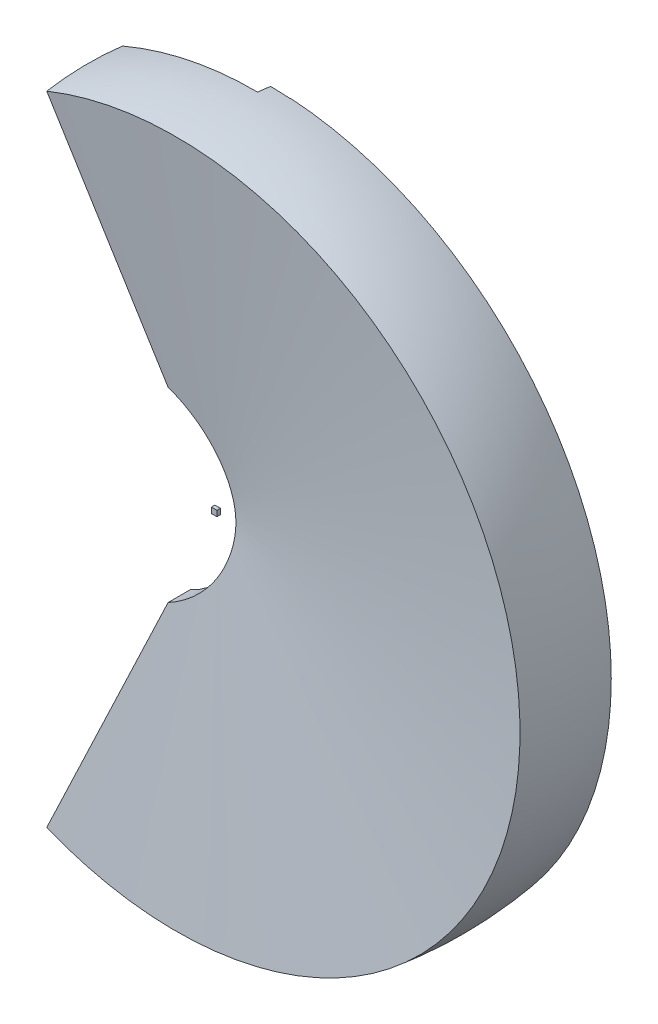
from build123d import *

# Parameters (mm, degrees)
SCHIZZO1_W                    = 65
SCHIZZO1_H                    = 65
ESTRUSIONE_ESTRUSIONE1_DEPTH  = 39.5
TAGLIO_ESTRUSIONE4_REACH      = 5711.959
TAGLIO_ESTRUSIONE4_END_RADIUS = 4000
SCHIZZO8_W                    = 775.2
SCHIZZO8_H                    = 1000
SCHIZZO8_W_2                  = 524.8
TAGLIA_RIVOLUZIONE1_ANGLE     = 135.87
TAGLIO_ESTRUSIONE8_START      = -1527.934401
TAGLIO_ESTRUSIONE8_DEPTH      = 1527.934401
TAGLIA_RIVOLUZIONE3_ANGLE     = 3.72
TAGLIO_ESTRUSIONE11_START     = -720.349185
SCHIZZO16_R                   = 1200
TAGLIO_ESTRUSIONE11_DEPTH     = 720.349185


with BuildPart() as part:
    # Schizzo1 → Estrusione-Estrusione1 (new body)
    with BuildSketch(Plane.XY):
        Rectangle(SCHIZZO1_W, SCHIZZO1_H)
    extrude(amount=ESTRUSIONE_ESTRUSIONE1_DEPTH)

    # Schizzo2 → Rivoluzione1 (revolve)
    with BuildSketch(Plane(origin=(0, 0, 0), x_dir=(1, 0, 0), z_dir=(0, 1, 0))):
        with BuildLine():
            Line((0, 0), (0, 20.5))
            Line((0, 20.5), (12.479983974, 20.5))
            ThreePointArc((12.479983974, 20.5), (20.922710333, 11.757558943), (24, 0))
            Line((24, 0), (0, 0))
        make_face()
    revolve(axis=Axis((0, 0, 0), (0, 0, -1)))


with BuildPart() as body_2:
    # Schizzo5 → Rivoluzione5 (revolve)
    with BuildSketch(Plane(origin=(0, 0, 0), x_dir=(1, 0, 0), z_dir=(0, 1, 0))):
        with BuildLine():
            Line((32.5, 3.509501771), (3970.184606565, -479.977373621))
            ThreePointArc((3970.184606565, -479.977373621), (3999.74044582, 53.06715998), (3958.048402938, 585.3))
            Line((3958.048402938, 585.3), (451.426834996, 585.3))
            Line((451.426834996, 585.3), (20.15926203, 33.302678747))
            ThreePointArc((20.15926203, 33.302678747), (30.251575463, 20.03061284), (32.5, 3.509501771))
        make_face()
    revolve(axis=Axis((0, 0, 992.5), (0, 0, -1)))

    # Taglio-Estrusione4: up to this sphere (the profile starts inside it)
    taglio_estrusione4_end = Location((0, 0, -7.5)) * Sphere(TAGLIO_ESTRUSIONE4_END_RADIUS, mode=Mode.PRIVATE)
    # Schizzo8 → Taglio-Estrusione4 (cut, up to the surface)
    with BuildSketch(Plane(origin=(32.5, 0, 0), x_dir=(0, 0, -1), z_dir=(1, 0, 0)), mode=Mode.PRIVATE) as taglio_estrusione4_sk1:
        with Locations((-427.1, 0)):
            Rectangle(SCHIZZO8_W, SCHIZZO8_H)
    taglio_estrusione4_tool1 = extrude(taglio_estrusione4_sk1.sketch, amount=-TAGLIO_ESTRUSIONE4_REACH, mode=Mode.PRIVATE) & taglio_estrusione4_end
    add(taglio_estrusione4_tool1.solids().sort_by_distance((32.5, 0, 427.1))[0], mode=Mode.SUBTRACT)
    # Schizzo8 → Taglio-Estrusione4 (cut, up to the surface)
    with BuildSketch(Plane(origin=(32.5, 0, 0), x_dir=(0, 0, -1), z_dir=(1, 0, 0)), mode=Mode.PRIVATE) as taglio_estrusione4_sk2:
        with Locations((322.9, 0)):
            Rectangle(SCHIZZO8_W_2, SCHIZZO8_H)
    taglio_estrusione4_tool2 = extrude(taglio_estrusione4_sk2.sketch, amount=-TAGLIO_ESTRUSIONE4_REACH, mode=Mode.PRIVATE) & taglio_estrusione4_end
    add(taglio_estrusione4_tool2.solids().sort_by_distance((32.5, 0, -322.9))[0], mode=Mode.SUBTRACT)

    # Schizzo11 → Taglia-Rivoluzione1 (revolve, symmetric, cut)
    with BuildSketch(Plane(origin=(0, 0, 0), x_dir=(1, 0, 0), z_dir=(0, 1, 0))) as taglia_rivoluzione1_sk:
        Polygon((0, -514.7), (-40000, -514.7), (-40000, 585.3), (0, 585.3), (0, 60.5), (-202.66, 60.5), (-202.66, -39.5), (0, -39.5), align=None)
    revolve(axis=Axis((0, 0, 992.5), (0, 0, -1)), revolution_arc=TAGLIA_RIVOLUZIONE1_ANGLE / 2, mode=Mode.SUBTRACT)
    revolve(taglia_rivoluzione1_sk.sketch, axis=Axis((0, 0, 992.5), (0, 0, 1)), revolution_arc=TAGLIA_RIVOLUZIONE1_ANGLE / 2, mode=Mode.SUBTRACT)

    # Schizzo12 → Taglio-Estrusione8 (cut)
    with BuildSketch(Plane(origin=(32.5, 0, 0), x_dir=(0, 0, -1), z_dir=(1, 0, 0)).offset(TAGLIO_ESTRUSIONE8_START)):
        Polygon((60.5, -500), (585.3, -5450.943396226), (585.3, 5450.942236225), (60.5, 499.998839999), align=None)
    extrude(amount=TAGLIO_ESTRUSIONE8_DEPTH, mode=Mode.SUBTRACT)

    # Schizzo15 → Taglia-Rivoluzione3 (revolve, cut)
    with BuildSketch(Plane(origin=(0, 0, 0), x_dir=(0, 0, -1), z_dir=(1, 0, 0))):
        Polygon((60.5, 0), (585.3, 0), (585.3, -4000), (60.231456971, -500.027232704), align=None)
    taglia_rivoluzione3 = revolve(axis=Axis((0, 0, 992.5), (0, 0, 1)), revolution_arc=TAGLIA_RIVOLUZIONE3_ANGLE, mode=Mode.SUBTRACT)

    # Schizzo16 → Taglio-Estrusione11 (cut)
    with BuildSketch(Plane(origin=(0, 0, -585.3), x_dir=(-1, 0, 0), z_dir=(0, 0, -1)).offset(TAGLIO_ESTRUSIONE11_START)):
        with Locations((967.5, 0)):
            Circle(SCHIZZO16_R)
    extrude(amount=TAGLIO_ESTRUSIONE11_DEPTH, mode=Mode.SUBTRACT)

    # Specchia2: Taglia-Rivoluzione3 across plane
    add(taglia_rivoluzione3.mirror(Plane.ZX), mode=Mode.SUBTRACT)


solid = Compound([part.part, body_2.part])
